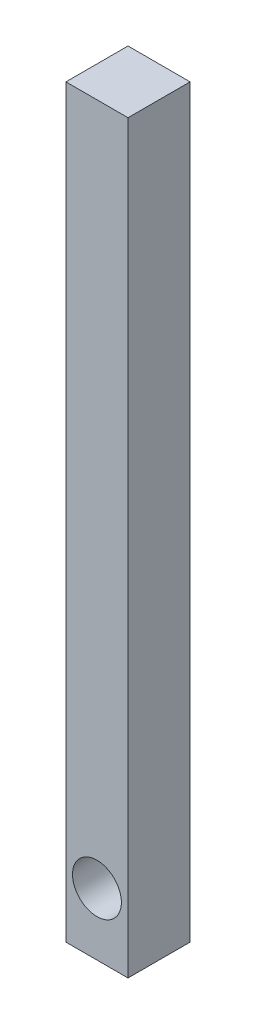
from build123d import *

# Parameters (mm, degrees)
SKETCH1_W           = 6.35
SKETCH1_H           = 76.2
BOSS_EXTRUDE1_DEPTH = 6.35
SKETCH2_R           = 2.5
CUT_EXTRUDE1_DEPTH  = 77.727341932


with BuildPart() as part:
    # Sketch1 → Boss-Extrude1 (new body)
    with BuildSketch(Plane.XY):
        with Locations((-3.175, 38.1)):
            Rectangle(SKETCH1_W, SKETCH1_H)
    extrude(amount=BOSS_EXTRUDE1_DEPTH)

    # Sketch2 → Cut-Extrude1 (cut, through all)
    with BuildSketch(Plane.XY.offset(6.35)):
        with Locations((-3.175, 6.35)):
            Circle(SKETCH2_R)
    extrude(amount=-CUT_EXTRUDE1_DEPTH, mode=Mode.SUBTRACT)


solid = part.part
